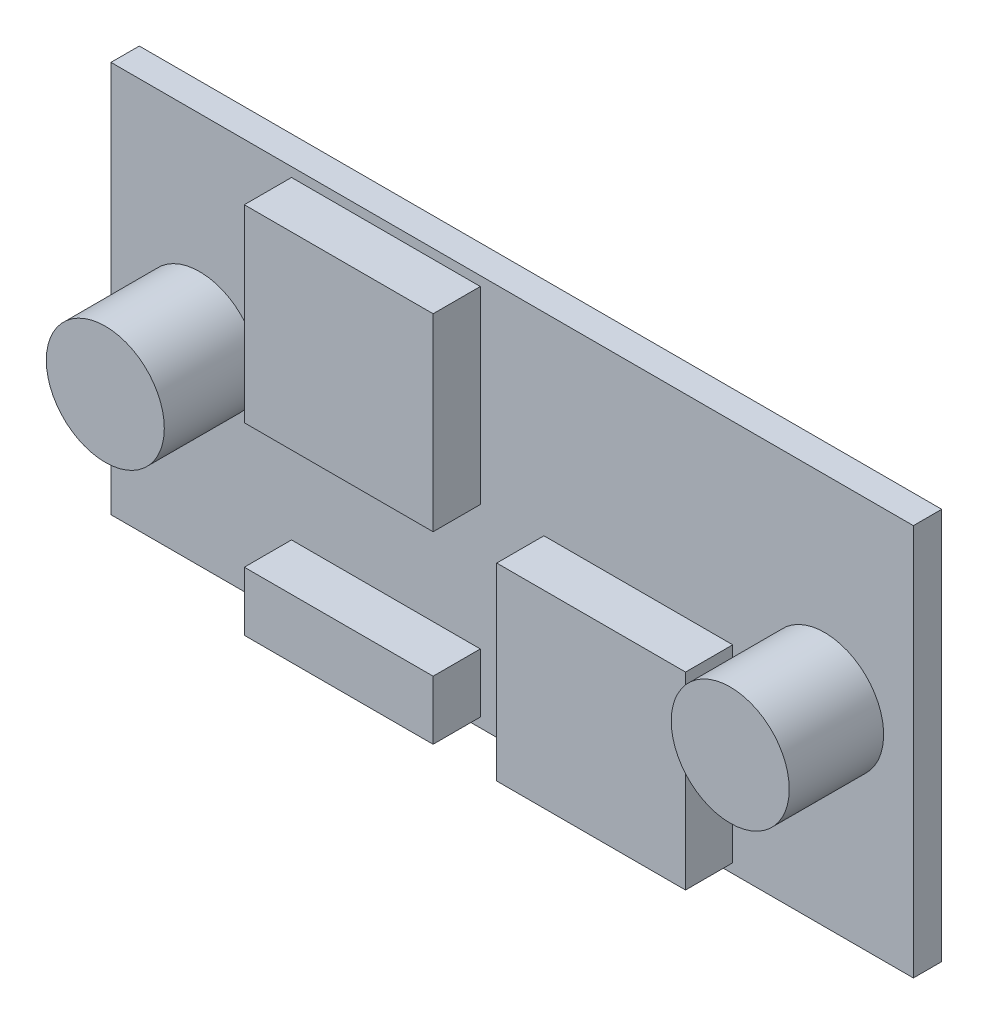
ISO-10303-21;
HEADER;
FILE_DESCRIPTION(('STEP AP214'),'2;1');
FILE_NAME('part.step','',(''),(''),'','','');
FILE_SCHEMA(('AUTOMOTIVE_DESIGN { 1 0 10303 214 1 1 1 1 }'));
ENDSEC;
DATA;
#1=APPLICATION_CONTEXT('core data for automotive mechanical design processes');
#2=APPLICATION_PROTOCOL_DEFINITION('international standard','automotive_design',2000,#1);
#3=PRODUCT_CONTEXT('',#1,'mechanical');
#4=PRODUCT('Part','Part','',(#3));
#5=PRODUCT_RELATED_PRODUCT_CATEGORY('part','',(#4));
#6=PRODUCT_DEFINITION_FORMATION('','',#4);
#7=PRODUCT_DEFINITION_CONTEXT('part definition',#1,'design');
#8=PRODUCT_DEFINITION('design','',#6,#7);
#9=PRODUCT_DEFINITION_SHAPE('','',#8);
#10=(LENGTH_UNIT() NAMED_UNIT(*) SI_UNIT(.MILLI.,.METRE.));
#11=(NAMED_UNIT(*) PLANE_ANGLE_UNIT() SI_UNIT($,.RADIAN.));
#12=(NAMED_UNIT(*) SI_UNIT($,.STERADIAN.) SOLID_ANGLE_UNIT());
#13=UNCERTAINTY_MEASURE_WITH_UNIT(LENGTH_MEASURE(1.E-05),#10,'distance_accuracy_value','');
#14=(GEOMETRIC_REPRESENTATION_CONTEXT(3) GLOBAL_UNCERTAINTY_ASSIGNED_CONTEXT((#13)) GLOBAL_UNIT_ASSIGNED_CONTEXT((#10,
#11,#12)) REPRESENTATION_CONTEXT('',''));
#15=CARTESIAN_POINT('',(0.,0.,0.));
#16=DIRECTION('',(0.,0.,1.));
#17=DIRECTION('',(1.,0.,0.));
#18=AXIS2_PLACEMENT_3D('',#15,#16,#17);
#19=CARTESIAN_POINT('',(0.,0.,1.524));
#20=DIRECTION('',(1.,0.,0.));
#21=DIRECTION('',(0.,1.,0.));
#22=AXIS2_PLACEMENT_3D('',#19,#20,#21);
#23=PLANE('',#22);
#24=DIRECTION('',(0.,-1.,0.));
#25=VECTOR('',#24,1.);
#26=CARTESIAN_POINT('',(0.,0.,0.));
#27=LINE('',#26,#25);
#28=CARTESIAN_POINT('',(0.,21.082,0.));
#29=VERTEX_POINT('',#28);
#30=CARTESIAN_POINT('',(0.,0.,0.));
#31=VERTEX_POINT('',#30);
#32=EDGE_CURVE('E282',#29,#31,#27,.T.);
#33=ORIENTED_EDGE('',*,*,#32,.T.);
#34=DIRECTION('',(0.,0.,-1.));
#35=VECTOR('',#34,1.);
#36=CARTESIAN_POINT('',(0.,0.,1.524));
#37=LINE('',#36,#35);
#38=CARTESIAN_POINT('',(0.,0.,1.524));
#39=VERTEX_POINT('',#38);
#40=EDGE_CURVE('E331',#39,#31,#37,.T.);
#41=ORIENTED_EDGE('',*,*,#40,.F.);
#42=DIRECTION('',(0.,-1.,0.));
#43=VECTOR('',#42,1.);
#44=CARTESIAN_POINT('',(0.,0.,1.524));
#45=LINE('',#44,#43);
#46=CARTESIAN_POINT('',(0.,21.082,1.524));
#47=VERTEX_POINT('',#46);
#48=EDGE_CURVE('E294',#47,#39,#45,.T.);
#49=ORIENTED_EDGE('',*,*,#48,.F.);
#50=DIRECTION('',(0.,0.,-1.));
#51=VECTOR('',#50,1.);
#52=CARTESIAN_POINT('',(0.,21.082,1.524));
#53=LINE('',#52,#51);
#54=EDGE_CURVE('E308',#47,#29,#53,.T.);
#55=ORIENTED_EDGE('',*,*,#54,.T.);
#56=EDGE_LOOP('',(#33,#41,#49,#55));
#57=FACE_BOUND('',#56,.T.);
#58=ADVANCED_FACE('F45',(#57),#23,.F.);
#59=CARTESIAN_POINT('',(0.,0.,1.524));
#60=DIRECTION('',(0.,1.,0.));
#61=DIRECTION('',(0.,0.,1.));
#62=AXIS2_PLACEMENT_3D('',#59,#60,#61);
#63=PLANE('',#62);
#64=DIRECTION('',(1.,0.,0.));
#65=VECTOR('',#64,1.);
#66=CARTESIAN_POINT('',(0.,0.,0.));
#67=LINE('',#66,#65);
#68=CARTESIAN_POINT('',(43.18,0.,0.));
#69=VERTEX_POINT('',#68);
#70=EDGE_CURVE('E312',#31,#69,#67,.T.);
#71=ORIENTED_EDGE('',*,*,#70,.T.);
#72=DIRECTION('',(0.,0.,-1.));
#73=VECTOR('',#72,1.);
#74=CARTESIAN_POINT('',(43.18,0.,1.524));
#75=LINE('',#74,#73);
#76=CARTESIAN_POINT('',(43.18,0.,1.524));
#77=VERTEX_POINT('',#76);
#78=EDGE_CURVE('E327',#77,#69,#75,.T.);
#79=ORIENTED_EDGE('',*,*,#78,.F.);
#80=DIRECTION('',(1.,0.,0.));
#81=VECTOR('',#80,1.);
#82=CARTESIAN_POINT('',(0.,0.,1.524));
#83=LINE('',#82,#81);
#84=EDGE_CURVE('E298',#39,#77,#83,.T.);
#85=ORIENTED_EDGE('',*,*,#84,.F.);
#86=ORIENTED_EDGE('',*,*,#40,.T.);
#87=EDGE_LOOP('',(#71,#79,#85,#86));
#88=FACE_BOUND('',#87,.T.);
#89=ADVANCED_FACE('F354',(#88),#63,.F.);
#90=CARTESIAN_POINT('',(43.18,0.,1.524));
#91=DIRECTION('',(-1.,0.,0.));
#92=DIRECTION('',(0.,-1.,0.));
#93=AXIS2_PLACEMENT_3D('',#90,#91,#92);
#94=PLANE('',#93);
#95=DIRECTION('',(0.,1.,0.));
#96=VECTOR('',#95,1.);
#97=CARTESIAN_POINT('',(43.18,0.,0.));
#98=LINE('',#97,#96);
#99=CARTESIAN_POINT('',(43.18,21.082,0.));
#100=VERTEX_POINT('',#99);
#101=EDGE_CURVE('E315',#69,#100,#98,.T.);
#102=ORIENTED_EDGE('',*,*,#101,.T.);
#103=DIRECTION('',(0.,0.,-1.));
#104=VECTOR('',#103,1.);
#105=CARTESIAN_POINT('',(43.18,21.082,1.524));
#106=LINE('',#105,#104);
#107=CARTESIAN_POINT('',(43.18,21.082,1.524));
#108=VERTEX_POINT('',#107);
#109=EDGE_CURVE('E323',#108,#100,#106,.T.);
#110=ORIENTED_EDGE('',*,*,#109,.F.);
#111=DIRECTION('',(0.,1.,0.));
#112=VECTOR('',#111,1.);
#113=CARTESIAN_POINT('',(43.18,0.,1.524));
#114=LINE('',#113,#112);
#115=EDGE_CURVE('E302',#77,#108,#114,.T.);
#116=ORIENTED_EDGE('',*,*,#115,.F.);
#117=ORIENTED_EDGE('',*,*,#78,.T.);
#118=EDGE_LOOP('',(#102,#110,#116,#117));
#119=FACE_BOUND('',#118,.T.);
#120=ADVANCED_FACE('F359',(#119),#94,.F.);
#121=CARTESIAN_POINT('',(0.,21.082,1.524));
#122=DIRECTION('',(0.,-1.,0.));
#123=DIRECTION('',(0.,0.,-1.));
#124=AXIS2_PLACEMENT_3D('',#121,#122,#123);
#125=PLANE('',#124);
#126=DIRECTION('',(-1.,0.,0.));
#127=VECTOR('',#126,1.);
#128=CARTESIAN_POINT('',(0.,21.082,0.));
#129=LINE('',#128,#127);
#130=EDGE_CURVE('E299',#100,#29,#129,.T.);
#131=ORIENTED_EDGE('',*,*,#130,.T.);
#132=ORIENTED_EDGE('',*,*,#54,.F.);
#133=DIRECTION('',(-1.,0.,0.));
#134=VECTOR('',#133,1.);
#135=CARTESIAN_POINT('',(0.,21.082,1.524));
#136=LINE('',#135,#134);
#137=EDGE_CURVE('E305',#108,#47,#136,.T.);
#138=ORIENTED_EDGE('',*,*,#137,.F.);
#139=ORIENTED_EDGE('',*,*,#109,.T.);
#140=EDGE_LOOP('',(#131,#132,#138,#139));
#141=FACE_BOUND('',#140,.T.);
#142=ADVANCED_FACE('F344',(#141),#125,.F.);
#143=CARTESIAN_POINT('',(0.,0.,1.524));
#144=DIRECTION('',(0.,0.,-1.));
#145=DIRECTION('',(-1.,0.,0.));
#146=AXIS2_PLACEMENT_3D('',#143,#144,#145);
#147=PLANE('',#146);
#148=DIRECTION('',(0.,-1.,0.));
#149=VECTOR('',#148,1.);
#150=CARTESIAN_POINT('',(9.71539849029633,20.574,1.524));
#151=LINE('',#150,#149);
#152=CARTESIAN_POINT('',(9.71539849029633,20.574,1.524));
#153=VERTEX_POINT('',#152);
#154=CARTESIAN_POINT('',(9.71539849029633,10.414,1.524));
#155=VERTEX_POINT('',#154);
#156=EDGE_CURVE('E60',#153,#155,#151,.T.);
#157=ORIENTED_EDGE('',*,*,#156,.F.);
#158=DIRECTION('',(-1.,0.,0.));
#159=VECTOR('',#158,1.);
#160=CARTESIAN_POINT('',(9.71539849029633,20.574,1.524));
#161=LINE('',#160,#159);
#162=CARTESIAN_POINT('',(19.8753984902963,20.574,1.524));
#163=VERTEX_POINT('',#162);
#164=EDGE_CURVE('E64',#163,#153,#161,.T.);
#165=ORIENTED_EDGE('',*,*,#164,.F.);
#166=DIRECTION('',(0.,1.,0.));
#167=VECTOR('',#166,1.);
#168=CARTESIAN_POINT('',(19.8753984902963,20.574,1.524));
#169=LINE('',#168,#167);
#170=CARTESIAN_POINT('',(19.8753984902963,10.414,1.524));
#171=VERTEX_POINT('',#170);
#172=EDGE_CURVE('E227',#171,#163,#169,.T.);
#173=ORIENTED_EDGE('',*,*,#172,.F.);
#174=DIRECTION('',(1.,0.,0.));
#175=VECTOR('',#174,1.);
#176=CARTESIAN_POINT('',(9.71539849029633,10.414,1.524));
#177=LINE('',#176,#175);
#178=EDGE_CURVE('E231',#155,#171,#177,.T.);
#179=ORIENTED_EDGE('',*,*,#178,.F.);
#180=EDGE_LOOP('',(#157,#165,#173,#179));
#181=FACE_BOUND('',#180,.T.);
#182=CARTESIAN_POINT('',(4.77519999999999,10.541,1.524));
#183=DIRECTION('',(0.,0.,-1.));
#184=DIRECTION('',(-1.,0.,0.));
#185=AXIS2_PLACEMENT_3D('',#182,#183,#184);
#186=CIRCLE('',#185,3.175);
#187=CARTESIAN_POINT('',(1.60019999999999,10.541,1.524));
#188=VERTEX_POINT('',#187);
#189=EDGE_CURVE('E11',#188,#188,#186,.F.);
#190=ORIENTED_EDGE('',*,*,#189,.F.);
#191=EDGE_LOOP('',(#190));
#192=FACE_BOUND('',#191,.T.);
#193=DIRECTION('',(0.,-1.,0.));
#194=VECTOR('',#193,1.);
#195=CARTESIAN_POINT('',(23.2988909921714,0.508,1.524));
#196=LINE('',#195,#194);
#197=CARTESIAN_POINT('',(23.2988909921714,10.668,1.524));
#198=VERTEX_POINT('',#197);
#199=CARTESIAN_POINT('',(23.2988909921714,0.508,1.524));
#200=VERTEX_POINT('',#199);
#201=EDGE_CURVE('E155',#198,#200,#196,.T.);
#202=ORIENTED_EDGE('',*,*,#201,.F.);
#203=DIRECTION('',(-1.,0.,0.));
#204=VECTOR('',#203,1.);
#205=CARTESIAN_POINT('',(23.2988909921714,10.668,1.524));
#206=LINE('',#205,#204);
#207=CARTESIAN_POINT('',(33.4588909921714,10.668,1.524));
#208=VERTEX_POINT('',#207);
#209=EDGE_CURVE('E159',#208,#198,#206,.T.);
#210=ORIENTED_EDGE('',*,*,#209,.F.);
#211=DIRECTION('',(0.,1.,0.));
#212=VECTOR('',#211,1.);
#213=CARTESIAN_POINT('',(33.4588909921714,0.508,1.524));
#214=LINE('',#213,#212);
#215=CARTESIAN_POINT('',(33.4588909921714,0.508,1.524));
#216=VERTEX_POINT('',#215);
#217=EDGE_CURVE('E180',#216,#208,#214,.T.);
#218=ORIENTED_EDGE('',*,*,#217,.F.);
#219=DIRECTION('',(1.,0.,0.));
#220=VECTOR('',#219,1.);
#221=CARTESIAN_POINT('',(23.2988909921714,0.508,1.524));
#222=LINE('',#221,#220);
#223=EDGE_CURVE('E162',#200,#216,#222,.T.);
#224=ORIENTED_EDGE('',*,*,#223,.F.);
#225=EDGE_LOOP('',(#202,#210,#218,#224));
#226=FACE_BOUND('',#225,.T.);
#227=DIRECTION('',(0.,-1.,0.));
#228=VECTOR('',#227,1.);
#229=CARTESIAN_POINT('',(9.71539849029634,3.683,1.524));
#230=LINE('',#229,#228);
#231=CARTESIAN_POINT('',(9.71539849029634,3.683,1.524));
#232=VERTEX_POINT('',#231);
#233=CARTESIAN_POINT('',(9.71539849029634,0.508,1.524));
#234=VERTEX_POINT('',#233);
#235=EDGE_CURVE('E278',#232,#234,#230,.T.);
#236=ORIENTED_EDGE('',*,*,#235,.F.);
#237=DIRECTION('',(-1.,0.,0.));
#238=VECTOR('',#237,1.);
#239=CARTESIAN_POINT('',(9.71539849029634,3.683,1.524));
#240=LINE('',#239,#238);
#241=CARTESIAN_POINT('',(19.8753984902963,3.683,1.524));
#242=VERTEX_POINT('',#241);
#243=EDGE_CURVE('E265',#242,#232,#240,.T.);
#244=ORIENTED_EDGE('',*,*,#243,.F.);
#245=DIRECTION('',(0.,1.,0.));
#246=VECTOR('',#245,1.);
#247=CARTESIAN_POINT('',(19.8753984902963,3.683,1.524));
#248=LINE('',#247,#246);
#249=CARTESIAN_POINT('',(19.8753984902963,0.508,1.524));
#250=VERTEX_POINT('',#249);
#251=EDGE_CURVE('E269',#250,#242,#248,.T.);
#252=ORIENTED_EDGE('',*,*,#251,.F.);
#253=DIRECTION('',(1.,0.,0.));
#254=VECTOR('',#253,1.);
#255=CARTESIAN_POINT('',(9.71539849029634,0.508,1.524));
#256=LINE('',#255,#254);
#257=EDGE_CURVE('E274',#234,#250,#256,.T.);
#258=ORIENTED_EDGE('',*,*,#257,.F.);
#259=EDGE_LOOP('',(#236,#244,#252,#258));
#260=FACE_BOUND('',#259,.T.);
#261=CARTESIAN_POINT('',(38.4048,10.541,1.524));
#262=DIRECTION('',(0.,0.,-1.));
#263=DIRECTION('',(-1.,0.,0.));
#264=AXIS2_PLACEMENT_3D('',#261,#262,#263);
#265=CIRCLE('',#264,3.175);
#266=CARTESIAN_POINT('',(35.2298,10.541,1.524));
#267=VERTEX_POINT('',#266);
#268=EDGE_CURVE('E53',#267,#267,#265,.F.);
#269=ORIENTED_EDGE('',*,*,#268,.F.);
#270=EDGE_LOOP('',(#269));
#271=FACE_BOUND('',#270,.T.);
#272=ORIENTED_EDGE('',*,*,#48,.T.);
#273=ORIENTED_EDGE('',*,*,#84,.T.);
#274=ORIENTED_EDGE('',*,*,#115,.T.);
#275=ORIENTED_EDGE('',*,*,#137,.T.);
#276=EDGE_LOOP('',(#272,#273,#274,#275));
#277=FACE_BOUND('',#276,.T.);
#278=ADVANCED_FACE('F157',(#181,#192,#226,#260,#271,#277),#147,.F.);
#279=CARTESIAN_POINT('',(0.,0.,0.));
#280=DIRECTION('',(0.,0.,-1.));
#281=DIRECTION('',(-1.,0.,0.));
#282=AXIS2_PLACEMENT_3D('',#279,#280,#281);
#283=PLANE('',#282);
#284=ORIENTED_EDGE('',*,*,#32,.F.);
#285=ORIENTED_EDGE('',*,*,#130,.F.);
#286=ORIENTED_EDGE('',*,*,#101,.F.);
#287=ORIENTED_EDGE('',*,*,#70,.F.);
#288=EDGE_LOOP('',(#284,#285,#286,#287));
#289=FACE_BOUND('',#288,.T.);
#290=ADVANCED_FACE('F343',(#289),#283,.T.);
#291=CARTESIAN_POINT('',(38.4048,10.541,4.064));
#292=DIRECTION('',(0.,0.,-1.));
#293=DIRECTION('',(-1.,0.,0.));
#294=AXIS2_PLACEMENT_3D('',#291,#292,#293);
#295=CYLINDRICAL_SURFACE('',#294,3.175);
#296=ORIENTED_EDGE('',*,*,#268,.T.);
#297=EDGE_LOOP('',(#296));
#298=FACE_BOUND('',#297,.T.);
#299=CARTESIAN_POINT('',(38.4048,10.541,6.604));
#300=DIRECTION('',(0.,0.,1.));
#301=DIRECTION('',(1.,0.,0.));
#302=AXIS2_PLACEMENT_3D('',#299,#300,#301);
#303=CIRCLE('',#302,3.175);
#304=CARTESIAN_POINT('',(41.5798,10.541,6.604));
#305=VERTEX_POINT('',#304);
#306=EDGE_CURVE('E599',#305,#305,#303,.T.);
#307=ORIENTED_EDGE('',*,*,#306,.F.);
#308=EDGE_LOOP('',(#307));
#309=FACE_BOUND('',#308,.T.);
#310=ADVANCED_FACE('F338',(#298,#309),#295,.T.);
#311=CARTESIAN_POINT('',(9.71539849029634,3.683,4.064));
#312=DIRECTION('',(1.,0.,0.));
#313=DIRECTION('',(0.,0.,-1.));
#314=AXIS2_PLACEMENT_3D('',#311,#312,#313);
#315=PLANE('',#314);
#316=ORIENTED_EDGE('',*,*,#235,.T.);
#317=DIRECTION('',(0.,0.,-1.));
#318=VECTOR('',#317,1.);
#319=CARTESIAN_POINT('',(9.71539849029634,0.508,4.064));
#320=LINE('',#319,#318);
#321=CARTESIAN_POINT('',(9.71539849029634,0.508,4.064));
#322=VERTEX_POINT('',#321);
#323=EDGE_CURVE('E168',#322,#234,#320,.T.);
#324=ORIENTED_EDGE('',*,*,#323,.F.);
#325=DIRECTION('',(0.,-1.,0.));
#326=VECTOR('',#325,1.);
#327=CARTESIAN_POINT('',(9.71539849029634,3.683,4.064));
#328=LINE('',#327,#326);
#329=CARTESIAN_POINT('',(9.71539849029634,3.683,4.064));
#330=VERTEX_POINT('',#329);
#331=EDGE_CURVE('E270',#330,#322,#328,.T.);
#332=ORIENTED_EDGE('',*,*,#331,.F.);
#333=DIRECTION('',(0.,0.,-1.));
#334=VECTOR('',#333,1.);
#335=CARTESIAN_POINT('',(9.71539849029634,3.683,4.064));
#336=LINE('',#335,#334);
#337=EDGE_CURVE('E260',#330,#232,#336,.T.);
#338=ORIENTED_EDGE('',*,*,#337,.T.);
#339=EDGE_LOOP('',(#316,#324,#332,#338));
#340=FACE_BOUND('',#339,.T.);
#341=ADVANCED_FACE('F369',(#340),#315,.F.);
#342=CARTESIAN_POINT('',(9.71539849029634,0.508,4.064));
#343=DIRECTION('',(0.,1.,0.));
#344=DIRECTION('',(-1.,0.,0.));
#345=AXIS2_PLACEMENT_3D('',#342,#343,#344);
#346=PLANE('',#345);
#347=ORIENTED_EDGE('',*,*,#257,.T.);
#348=DIRECTION('',(0.,0.,-1.));
#349=VECTOR('',#348,1.);
#350=CARTESIAN_POINT('',(19.8753984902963,0.508,4.064));
#351=LINE('',#350,#349);
#352=CARTESIAN_POINT('',(19.8753984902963,0.508,4.064));
#353=VERTEX_POINT('',#352);
#354=EDGE_CURVE('E252',#353,#250,#351,.T.);
#355=ORIENTED_EDGE('',*,*,#354,.F.);
#356=DIRECTION('',(1.,0.,0.));
#357=VECTOR('',#356,1.);
#358=CARTESIAN_POINT('',(9.71539849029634,0.508,4.064));
#359=LINE('',#358,#357);
#360=EDGE_CURVE('E288',#322,#353,#359,.T.);
#361=ORIENTED_EDGE('',*,*,#360,.F.);
#362=ORIENTED_EDGE('',*,*,#323,.T.);
#363=EDGE_LOOP('',(#347,#355,#361,#362));
#364=FACE_BOUND('',#363,.T.);
#365=ADVANCED_FACE('F420',(#364),#346,.F.);
#366=CARTESIAN_POINT('',(19.8753984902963,3.683,4.064));
#367=DIRECTION('',(-1.,0.,0.));
#368=DIRECTION('',(0.,0.,1.));
#369=AXIS2_PLACEMENT_3D('',#366,#367,#368);
#370=PLANE('',#369);
#371=ORIENTED_EDGE('',*,*,#251,.T.);
#372=DIRECTION('',(0.,0.,-1.));
#373=VECTOR('',#372,1.);
#374=CARTESIAN_POINT('',(19.8753984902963,3.683,4.064));
#375=LINE('',#374,#373);
#376=CARTESIAN_POINT('',(19.8753984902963,3.683,4.064));
#377=VERTEX_POINT('',#376);
#378=EDGE_CURVE('E256',#377,#242,#375,.T.);
#379=ORIENTED_EDGE('',*,*,#378,.F.);
#380=DIRECTION('',(0.,1.,0.));
#381=VECTOR('',#380,1.);
#382=CARTESIAN_POINT('',(19.8753984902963,3.683,4.064));
#383=LINE('',#382,#381);
#384=EDGE_CURVE('E285',#353,#377,#383,.T.);
#385=ORIENTED_EDGE('',*,*,#384,.F.);
#386=ORIENTED_EDGE('',*,*,#354,.T.);
#387=EDGE_LOOP('',(#371,#379,#385,#386));
#388=FACE_BOUND('',#387,.T.);
#389=ADVANCED_FACE('F429',(#388),#370,.F.);
#390=CARTESIAN_POINT('',(9.71539849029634,3.683,4.064));
#391=DIRECTION('',(0.,-1.,0.));
#392=DIRECTION('',(0.,0.,-1.));
#393=AXIS2_PLACEMENT_3D('',#390,#391,#392);
#394=PLANE('',#393);
#395=ORIENTED_EDGE('',*,*,#243,.T.);
#396=ORIENTED_EDGE('',*,*,#337,.F.);
#397=DIRECTION('',(-1.,0.,0.));
#398=VECTOR('',#397,1.);
#399=CARTESIAN_POINT('',(9.71539849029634,3.683,4.064));
#400=LINE('',#399,#398);
#401=EDGE_CURVE('E264',#377,#330,#400,.T.);
#402=ORIENTED_EDGE('',*,*,#401,.F.);
#403=ORIENTED_EDGE('',*,*,#378,.T.);
#404=EDGE_LOOP('',(#395,#396,#402,#403));
#405=FACE_BOUND('',#404,.T.);
#406=ADVANCED_FACE('F438',(#405),#394,.F.);
#407=CARTESIAN_POINT('',(0.,0.,4.064));
#408=DIRECTION('',(0.,0.,1.));
#409=DIRECTION('',(1.,0.,0.));
#410=AXIS2_PLACEMENT_3D('',#407,#408,#409);
#411=PLANE('',#410);
#412=ORIENTED_EDGE('',*,*,#331,.T.);
#413=ORIENTED_EDGE('',*,*,#360,.T.);
#414=ORIENTED_EDGE('',*,*,#384,.T.);
#415=ORIENTED_EDGE('',*,*,#401,.T.);
#416=EDGE_LOOP('',(#412,#413,#414,#415));
#417=FACE_BOUND('',#416,.T.);
#418=ADVANCED_FACE('F447',(#417),#411,.T.);
#419=CARTESIAN_POINT('',(23.2988909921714,0.508,4.064));
#420=DIRECTION('',(1.,0.,0.));
#421=DIRECTION('',(0.,0.,-1.));
#422=AXIS2_PLACEMENT_3D('',#419,#420,#421);
#423=PLANE('',#422);
#424=ORIENTED_EDGE('',*,*,#201,.T.);
#425=DIRECTION('',(0.,0.,-1.));
#426=VECTOR('',#425,1.);
#427=CARTESIAN_POINT('',(23.2988909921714,0.508,4.064));
#428=LINE('',#427,#426);
#429=CARTESIAN_POINT('',(23.2988909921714,0.508,4.064));
#430=VERTEX_POINT('',#429);
#431=EDGE_CURVE('E237',#430,#200,#428,.T.);
#432=ORIENTED_EDGE('',*,*,#431,.F.);
#433=DIRECTION('',(0.,-1.,0.));
#434=VECTOR('',#433,1.);
#435=CARTESIAN_POINT('',(23.2988909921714,0.508,4.064));
#436=LINE('',#435,#434);
#437=CARTESIAN_POINT('',(23.2988909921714,10.668,4.064));
#438=VERTEX_POINT('',#437);
#439=EDGE_CURVE('E181',#438,#430,#436,.T.);
#440=ORIENTED_EDGE('',*,*,#439,.F.);
#441=DIRECTION('',(0.,0.,-1.));
#442=VECTOR('',#441,1.);
#443=CARTESIAN_POINT('',(23.2988909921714,10.668,4.064));
#444=LINE('',#443,#442);
#445=EDGE_CURVE('E175',#438,#198,#444,.T.);
#446=ORIENTED_EDGE('',*,*,#445,.T.);
#447=EDGE_LOOP('',(#424,#432,#440,#446));
#448=FACE_BOUND('',#447,.T.);
#449=ADVANCED_FACE('F183',(#448),#423,.F.);
#450=CARTESIAN_POINT('',(23.2988909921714,0.508,4.064));
#451=DIRECTION('',(0.,1.,0.));
#452=DIRECTION('',(0.,0.,1.));
#453=AXIS2_PLACEMENT_3D('',#450,#451,#452);
#454=PLANE('',#453);
#455=ORIENTED_EDGE('',*,*,#223,.T.);
#456=DIRECTION('',(0.,0.,-1.));
#457=VECTOR('',#456,1.);
#458=CARTESIAN_POINT('',(33.4588909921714,0.508,4.064));
#459=LINE('',#458,#457);
#460=CARTESIAN_POINT('',(33.4588909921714,0.508,4.064));
#461=VERTEX_POINT('',#460);
#462=EDGE_CURVE('E192',#461,#216,#459,.T.);
#463=ORIENTED_EDGE('',*,*,#462,.F.);
#464=DIRECTION('',(1.,0.,0.));
#465=VECTOR('',#464,1.);
#466=CARTESIAN_POINT('',(23.2988909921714,0.508,4.064));
#467=LINE('',#466,#465);
#468=EDGE_CURVE('E202',#430,#461,#467,.T.);
#469=ORIENTED_EDGE('',*,*,#468,.F.);
#470=ORIENTED_EDGE('',*,*,#431,.T.);
#471=EDGE_LOOP('',(#455,#463,#469,#470));
#472=FACE_BOUND('',#471,.T.);
#473=ADVANCED_FACE('F464',(#472),#454,.F.);
#474=CARTESIAN_POINT('',(33.4588909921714,0.508,4.064));
#475=DIRECTION('',(-1.,0.,0.));
#476=DIRECTION('',(0.,0.,1.));
#477=AXIS2_PLACEMENT_3D('',#474,#475,#476);
#478=PLANE('',#477);
#479=ORIENTED_EDGE('',*,*,#217,.T.);
#480=DIRECTION('',(0.,0.,-1.));
#481=VECTOR('',#480,1.);
#482=CARTESIAN_POINT('',(33.4588909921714,10.668,4.064));
#483=LINE('',#482,#481);
#484=CARTESIAN_POINT('',(33.4588909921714,10.668,4.064));
#485=VERTEX_POINT('',#484);
#486=EDGE_CURVE('E178',#485,#208,#483,.T.);
#487=ORIENTED_EDGE('',*,*,#486,.F.);
#488=DIRECTION('',(0.,1.,0.));
#489=VECTOR('',#488,1.);
#490=CARTESIAN_POINT('',(33.4588909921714,0.508,4.064));
#491=LINE('',#490,#489);
#492=EDGE_CURVE('E190',#461,#485,#491,.T.);
#493=ORIENTED_EDGE('',*,*,#492,.F.);
#494=ORIENTED_EDGE('',*,*,#462,.T.);
#495=EDGE_LOOP('',(#479,#487,#493,#494));
#496=FACE_BOUND('',#495,.T.);
#497=ADVANCED_FACE('F472',(#496),#478,.F.);
#498=CARTESIAN_POINT('',(23.2988909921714,10.668,4.064));
#499=DIRECTION('',(0.,-1.,0.));
#500=DIRECTION('',(0.,0.,-1.));
#501=AXIS2_PLACEMENT_3D('',#498,#499,#500);
#502=PLANE('',#501);
#503=ORIENTED_EDGE('',*,*,#209,.T.);
#504=ORIENTED_EDGE('',*,*,#445,.F.);
#505=DIRECTION('',(-1.,0.,0.));
#506=VECTOR('',#505,1.);
#507=CARTESIAN_POINT('',(23.2988909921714,10.668,4.064));
#508=LINE('',#507,#506);
#509=EDGE_CURVE('E186',#485,#438,#508,.T.);
#510=ORIENTED_EDGE('',*,*,#509,.F.);
#511=ORIENTED_EDGE('',*,*,#486,.T.);
#512=EDGE_LOOP('',(#503,#504,#510,#511));
#513=FACE_BOUND('',#512,.T.);
#514=ADVANCED_FACE('F173',(#513),#502,.F.);
#515=CARTESIAN_POINT('',(0.,0.,4.064));
#516=DIRECTION('',(0.,0.,-1.));
#517=DIRECTION('',(-1.,0.,0.));
#518=AXIS2_PLACEMENT_3D('',#515,#516,#517);
#519=PLANE('',#518);
#520=ORIENTED_EDGE('',*,*,#439,.T.);
#521=ORIENTED_EDGE('',*,*,#468,.T.);
#522=ORIENTED_EDGE('',*,*,#492,.T.);
#523=ORIENTED_EDGE('',*,*,#509,.T.);
#524=EDGE_LOOP('',(#520,#521,#522,#523));
#525=FACE_BOUND('',#524,.T.);
#526=ADVANCED_FACE('F489',(#525),#519,.F.);
#527=CARTESIAN_POINT('',(4.77519999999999,10.541,4.064));
#528=DIRECTION('',(0.,0.,-1.));
#529=DIRECTION('',(-1.,0.,0.));
#530=AXIS2_PLACEMENT_3D('',#527,#528,#529);
#531=CYLINDRICAL_SURFACE('',#530,3.175);
#532=ORIENTED_EDGE('',*,*,#189,.T.);
#533=EDGE_LOOP('',(#532));
#534=FACE_BOUND('',#533,.T.);
#535=CARTESIAN_POINT('',(4.77519999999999,10.541,6.604));
#536=DIRECTION('',(0.,0.,1.));
#537=DIRECTION('',(1.,0.,0.));
#538=AXIS2_PLACEMENT_3D('',#535,#536,#537);
#539=CIRCLE('',#538,3.175);
#540=CARTESIAN_POINT('',(7.95019999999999,10.541,6.604));
#541=VERTEX_POINT('',#540);
#542=EDGE_CURVE('E212',#541,#541,#539,.T.);
#543=ORIENTED_EDGE('',*,*,#542,.F.);
#544=EDGE_LOOP('',(#543));
#545=FACE_BOUND('',#544,.T.);
#546=ADVANCED_FACE('F497',(#534,#545),#531,.T.);
#547=CARTESIAN_POINT('',(9.71539849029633,20.574,4.064));
#548=DIRECTION('',(1.,0.,0.));
#549=DIRECTION('',(0.,0.,-1.));
#550=AXIS2_PLACEMENT_3D('',#547,#548,#549);
#551=PLANE('',#550);
#552=ORIENTED_EDGE('',*,*,#156,.T.);
#553=DIRECTION('',(0.,0.,-1.));
#554=VECTOR('',#553,1.);
#555=CARTESIAN_POINT('',(9.71539849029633,10.414,4.064));
#556=LINE('',#555,#554);
#557=CARTESIAN_POINT('',(9.71539849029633,10.414,4.064));
#558=VERTEX_POINT('',#557);
#559=EDGE_CURVE('E207',#558,#155,#556,.T.);
#560=ORIENTED_EDGE('',*,*,#559,.F.);
#561=DIRECTION('',(0.,-1.,0.));
#562=VECTOR('',#561,1.);
#563=CARTESIAN_POINT('',(9.71539849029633,20.574,4.064));
#564=LINE('',#563,#562);
#565=CARTESIAN_POINT('',(9.71539849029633,20.574,4.064));
#566=VERTEX_POINT('',#565);
#567=EDGE_CURVE('E228',#566,#558,#564,.T.);
#568=ORIENTED_EDGE('',*,*,#567,.F.);
#569=DIRECTION('',(0.,0.,-1.));
#570=VECTOR('',#569,1.);
#571=CARTESIAN_POINT('',(9.71539849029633,20.574,4.064));
#572=LINE('',#571,#570);
#573=EDGE_CURVE('E220',#566,#153,#572,.T.);
#574=ORIENTED_EDGE('',*,*,#573,.T.);
#575=EDGE_LOOP('',(#552,#560,#568,#574));
#576=FACE_BOUND('',#575,.T.);
#577=ADVANCED_FACE('F506',(#576),#551,.F.);
#578=CARTESIAN_POINT('',(9.71539849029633,10.414,4.064));
#579=DIRECTION('',(0.,1.,0.));
#580=DIRECTION('',(-1.,0.,0.));
#581=AXIS2_PLACEMENT_3D('',#578,#579,#580);
#582=PLANE('',#581);
#583=ORIENTED_EDGE('',*,*,#178,.T.);
#584=DIRECTION('',(0.,0.,-1.));
#585=VECTOR('',#584,1.);
#586=CARTESIAN_POINT('',(19.8753984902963,10.414,4.064));
#587=LINE('',#586,#585);
#588=CARTESIAN_POINT('',(19.8753984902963,10.414,4.064));
#589=VERTEX_POINT('',#588);
#590=EDGE_CURVE('E211',#589,#171,#587,.T.);
#591=ORIENTED_EDGE('',*,*,#590,.F.);
#592=DIRECTION('',(1.,0.,0.));
#593=VECTOR('',#592,1.);
#594=CARTESIAN_POINT('',(9.71539849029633,10.414,4.064));
#595=LINE('',#594,#593);
#596=EDGE_CURVE('E243',#558,#589,#595,.T.);
#597=ORIENTED_EDGE('',*,*,#596,.F.);
#598=ORIENTED_EDGE('',*,*,#559,.T.);
#599=EDGE_LOOP('',(#583,#591,#597,#598));
#600=FACE_BOUND('',#599,.T.);
#601=ADVANCED_FACE('F516',(#600),#582,.F.);
#602=CARTESIAN_POINT('',(19.8753984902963,20.574,4.064));
#603=DIRECTION('',(-1.,0.,0.));
#604=DIRECTION('',(0.,0.,1.));
#605=AXIS2_PLACEMENT_3D('',#602,#603,#604);
#606=PLANE('',#605);
#607=ORIENTED_EDGE('',*,*,#172,.T.);
#608=DIRECTION('',(0.,0.,-1.));
#609=VECTOR('',#608,1.);
#610=CARTESIAN_POINT('',(19.8753984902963,20.574,4.064));
#611=LINE('',#610,#609);
#612=CARTESIAN_POINT('',(19.8753984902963,20.574,4.064));
#613=VERTEX_POINT('',#612);
#614=EDGE_CURVE('E216',#613,#163,#611,.T.);
#615=ORIENTED_EDGE('',*,*,#614,.F.);
#616=DIRECTION('',(0.,1.,0.));
#617=VECTOR('',#616,1.);
#618=CARTESIAN_POINT('',(19.8753984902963,20.574,4.064));
#619=LINE('',#618,#617);
#620=EDGE_CURVE('E240',#589,#613,#619,.T.);
#621=ORIENTED_EDGE('',*,*,#620,.F.);
#622=ORIENTED_EDGE('',*,*,#590,.T.);
#623=EDGE_LOOP('',(#607,#615,#621,#622));
#624=FACE_BOUND('',#623,.T.);
#625=ADVANCED_FACE('F525',(#624),#606,.F.);
#626=CARTESIAN_POINT('',(9.71539849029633,20.574,4.064));
#627=DIRECTION('',(0.,-1.,0.));
#628=DIRECTION('',(0.,0.,-1.));
#629=AXIS2_PLACEMENT_3D('',#626,#627,#628);
#630=PLANE('',#629);
#631=ORIENTED_EDGE('',*,*,#164,.T.);
#632=ORIENTED_EDGE('',*,*,#573,.F.);
#633=DIRECTION('',(-1.,0.,0.));
#634=VECTOR('',#633,1.);
#635=CARTESIAN_POINT('',(9.71539849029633,20.574,4.064));
#636=LINE('',#635,#634);
#637=EDGE_CURVE('E224',#613,#566,#636,.T.);
#638=ORIENTED_EDGE('',*,*,#637,.F.);
#639=ORIENTED_EDGE('',*,*,#614,.T.);
#640=EDGE_LOOP('',(#631,#632,#638,#639));
#641=FACE_BOUND('',#640,.T.);
#642=ADVANCED_FACE('F534',(#641),#630,.F.);
#643=CARTESIAN_POINT('',(0.,0.,4.064));
#644=DIRECTION('',(0.,0.,1.));
#645=DIRECTION('',(1.,0.,0.));
#646=AXIS2_PLACEMENT_3D('',#643,#644,#645);
#647=PLANE('',#646);
#648=ORIENTED_EDGE('',*,*,#567,.T.);
#649=ORIENTED_EDGE('',*,*,#596,.T.);
#650=ORIENTED_EDGE('',*,*,#620,.T.);
#651=ORIENTED_EDGE('',*,*,#637,.T.);
#652=EDGE_LOOP('',(#648,#649,#650,#651));
#653=FACE_BOUND('',#652,.T.);
#654=ADVANCED_FACE('F543',(#653),#647,.T.);
#655=CARTESIAN_POINT('',(4.77519999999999,10.541,6.604));
#656=DIRECTION('',(0.,0.,1.));
#657=DIRECTION('',(1.,0.,0.));
#658=AXIS2_PLACEMENT_3D('',#655,#656,#657);
#659=PLANE('',#658);
#660=ORIENTED_EDGE('',*,*,#542,.T.);
#661=EDGE_LOOP('',(#660));
#662=FACE_BOUND('',#661,.T.);
#663=ADVANCED_FACE('F552',(#662),#659,.T.);
#664=CARTESIAN_POINT('',(38.4048,10.541,6.604));
#665=DIRECTION('',(0.,0.,1.));
#666=DIRECTION('',(1.,0.,0.));
#667=AXIS2_PLACEMENT_3D('',#664,#665,#666);
#668=PLANE('',#667);
#669=ORIENTED_EDGE('',*,*,#306,.T.);
#670=EDGE_LOOP('',(#669));
#671=FACE_BOUND('',#670,.T.);
#672=ADVANCED_FACE('F561',(#671),#668,.T.);
#673=CLOSED_SHELL('',(#58,#89,#120,#142,#278,#290,#310,#341,#365,#389,#406,#418,#449,#473,#497,
#514,#526,#546,#577,#601,#625,#642,#654,#663,#672));
#674=MANIFOLD_SOLID_BREP('B2',#673);
#675=ADVANCED_BREP_SHAPE_REPRESENTATION('',(#18,#674),#14);
#676=SHAPE_DEFINITION_REPRESENTATION(#9,#675);
ENDSEC;
END-ISO-10303-21;
